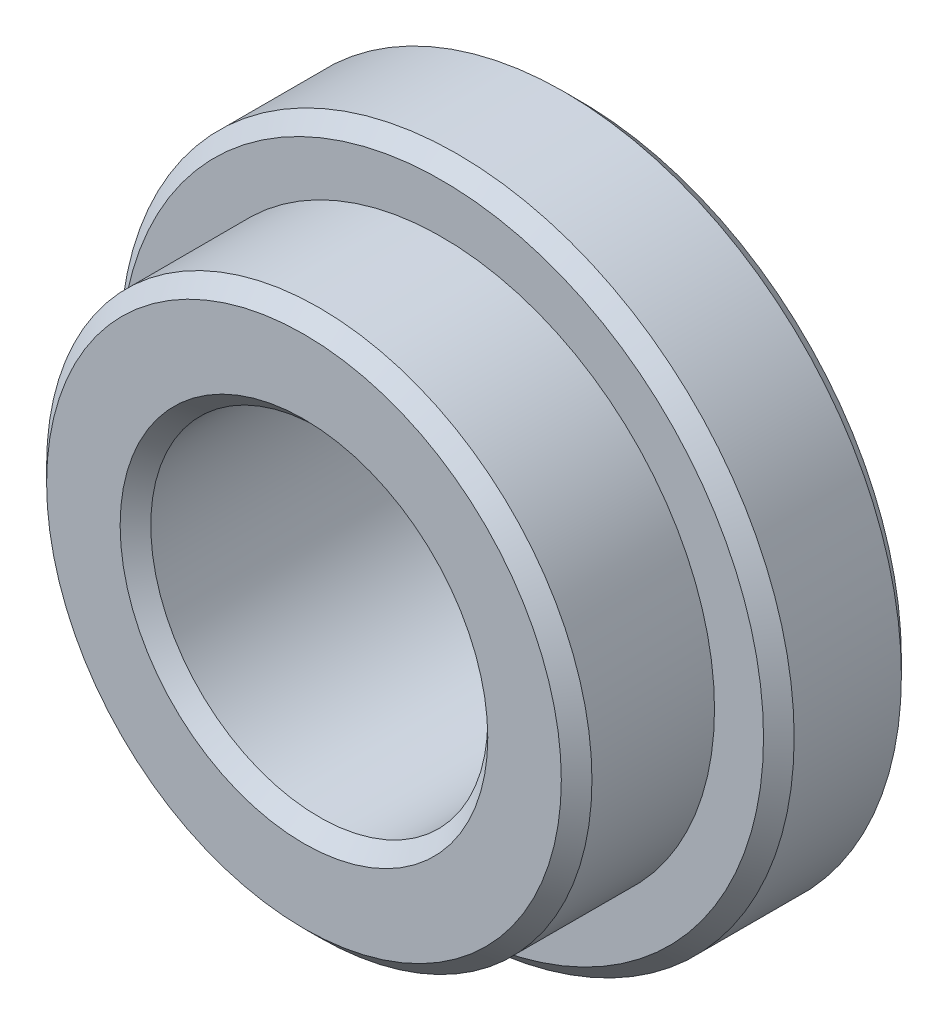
ISO-10303-21;
HEADER;
FILE_DESCRIPTION(('STEP AP214'),'2;1');
FILE_NAME('part.step','',(''),(''),'','','');
FILE_SCHEMA(('AUTOMOTIVE_DESIGN { 1 0 10303 214 1 1 1 1 }'));
ENDSEC;
DATA;
#1=APPLICATION_CONTEXT('core data for automotive mechanical design processes');
#2=APPLICATION_PROTOCOL_DEFINITION('international standard','automotive_design',2000,#1);
#3=PRODUCT_CONTEXT('',#1,'mechanical');
#4=PRODUCT('Part','Part','',(#3));
#5=PRODUCT_RELATED_PRODUCT_CATEGORY('part','',(#4));
#6=PRODUCT_DEFINITION_FORMATION('','',#4);
#7=PRODUCT_DEFINITION_CONTEXT('part definition',#1,'design');
#8=PRODUCT_DEFINITION('design','',#6,#7);
#9=PRODUCT_DEFINITION_SHAPE('','',#8);
#10=(LENGTH_UNIT() NAMED_UNIT(*) SI_UNIT(.MILLI.,.METRE.));
#11=(NAMED_UNIT(*) PLANE_ANGLE_UNIT() SI_UNIT($,.RADIAN.));
#12=(NAMED_UNIT(*) SI_UNIT($,.STERADIAN.) SOLID_ANGLE_UNIT());
#13=UNCERTAINTY_MEASURE_WITH_UNIT(LENGTH_MEASURE(1.E-05),#10,'distance_accuracy_value','');
#14=(GEOMETRIC_REPRESENTATION_CONTEXT(3) GLOBAL_UNCERTAINTY_ASSIGNED_CONTEXT((#13)) GLOBAL_UNIT_ASSIGNED_CONTEXT((#10,
#11,#12)) REPRESENTATION_CONTEXT('',''));
#15=CARTESIAN_POINT('',(0.,0.,0.));
#16=DIRECTION('',(0.,0.,1.));
#17=DIRECTION('',(1.,0.,0.));
#18=AXIS2_PLACEMENT_3D('',#15,#16,#17);
#19=CARTESIAN_POINT('',(0.,0.,8.49999999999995));
#20=DIRECTION('',(0.,0.,-1.));
#21=DIRECTION('',(-1.,0.,0.));
#22=AXIS2_PLACEMENT_3D('',#19,#20,#21);
#23=CONICAL_SURFACE('',#22,8.89999999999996,0.785398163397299);
#24=CARTESIAN_POINT('',(0.,0.,8.49999999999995));
#25=DIRECTION('',(0.,0.,1.));
#26=DIRECTION('',(1.,0.,0.));
#27=AXIS2_PLACEMENT_3D('',#24,#25,#26);
#28=CIRCLE('',#27,8.9);
#29=CARTESIAN_POINT('',(8.9,0.,8.49999999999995));
#30=VERTEX_POINT('',#29);
#31=EDGE_CURVE('E55',#30,#30,#28,.F.);
#32=ORIENTED_EDGE('',*,*,#31,.F.);
#33=EDGE_LOOP('',(#32));
#34=FACE_BOUND('',#33,.T.);
#35=CARTESIAN_POINT('',(0.,0.,9.00000000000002));
#36=DIRECTION('',(0.,0.,-1.));
#37=DIRECTION('',(-1.,0.,0.));
#38=AXIS2_PLACEMENT_3D('',#35,#36,#37);
#39=CIRCLE('',#38,8.40000000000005);
#40=CARTESIAN_POINT('',(-8.40000000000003,0.,9.00000000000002));
#41=VERTEX_POINT('',#40);
#42=EDGE_CURVE('E19',#41,#41,#39,.F.);
#43=ORIENTED_EDGE('',*,*,#42,.F.);
#44=EDGE_LOOP('',(#43));
#45=FACE_BOUND('',#44,.T.);
#46=ADVANCED_FACE('F16',(#34,#45),#23,.T.);
#47=CARTESIAN_POINT('',(0.,0.,-0.450000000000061));
#48=DIRECTION('',(0.,0.,1.));
#49=DIRECTION('',(1.,0.,0.));
#50=AXIS2_PLACEMENT_3D('',#47,#48,#49);
#51=CYLINDRICAL_SURFACE('',#50,8.9);
#52=ORIENTED_EDGE('',*,*,#31,.T.);
#53=EDGE_LOOP('',(#52));
#54=FACE_BOUND('',#53,.T.);
#55=CARTESIAN_POINT('',(0.,0.,4.49999999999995));
#56=DIRECTION('',(0.,0.,1.));
#57=DIRECTION('',(1.,0.,0.));
#58=AXIS2_PLACEMENT_3D('',#55,#56,#57);
#59=CIRCLE('',#58,8.9);
#60=CARTESIAN_POINT('',(8.9,0.,4.49999999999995));
#61=VERTEX_POINT('',#60);
#62=EDGE_CURVE('E71',#61,#61,#59,.F.);
#63=ORIENTED_EDGE('',*,*,#62,.F.);
#64=EDGE_LOOP('',(#63));
#65=FACE_BOUND('',#64,.T.);
#66=ADVANCED_FACE('F82',(#54,#65),#51,.T.);
#67=CARTESIAN_POINT('',(0.,0.,9.00000000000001));
#68=DIRECTION('',(0.,0.,1.));
#69=DIRECTION('',(1.,0.,0.));
#70=AXIS2_PLACEMENT_3D('',#67,#68,#69);
#71=PLANE('',#70);
#72=ORIENTED_EDGE('',*,*,#42,.T.);
#73=EDGE_LOOP('',(#72));
#74=FACE_BOUND('',#73,.T.);
#75=CARTESIAN_POINT('',(0.,0.,9.00000000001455));
#76=DIRECTION('',(0.,0.,1.));
#77=DIRECTION('',(1.,0.,0.));
#78=AXIS2_PLACEMENT_3D('',#75,#76,#77);
#79=CIRCLE('',#78,5.9999999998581);
#80=CARTESIAN_POINT('',(5.99999999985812,0.,9.00000000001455));
#81=VERTEX_POINT('',#80);
#82=EDGE_CURVE('E69',#81,#81,#79,.F.);
#83=ORIENTED_EDGE('',*,*,#82,.T.);
#84=EDGE_LOOP('',(#83));
#85=FACE_BOUND('',#84,.T.);
#86=ADVANCED_FACE('F78',(#74,#85),#71,.T.);
#87=CARTESIAN_POINT('',(0.,0.,4.49999999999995));
#88=DIRECTION('',(0.,0.,1.));
#89=DIRECTION('',(1.,0.,0.));
#90=AXIS2_PLACEMENT_3D('',#87,#88,#89);
#91=PLANE('',#90);
#92=CARTESIAN_POINT('',(0.,0.,4.50000000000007));
#93=DIRECTION('',(0.,0.,-1.));
#94=DIRECTION('',(-1.,0.,0.));
#95=AXIS2_PLACEMENT_3D('',#92,#93,#94);
#96=CIRCLE('',#95,10.5);
#97=CARTESIAN_POINT('',(-10.5,0.,4.50000000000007));
#98=VERTEX_POINT('',#97);
#99=EDGE_CURVE('E54',#98,#98,#96,.T.);
#100=ORIENTED_EDGE('',*,*,#99,.F.);
#101=EDGE_LOOP('',(#100));
#102=FACE_BOUND('',#101,.T.);
#103=ORIENTED_EDGE('',*,*,#62,.T.);
#104=EDGE_LOOP('',(#103));
#105=FACE_BOUND('',#104,.T.);
#106=ADVANCED_FACE('F130',(#102,#105),#91,.T.);
#107=CARTESIAN_POINT('',(0.,0.,9.00000000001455));
#108=DIRECTION('',(0.,0.,1.));
#109=DIRECTION('',(1.,0.,0.));
#110=AXIS2_PLACEMENT_3D('',#107,#108,#109);
#111=CONICAL_SURFACE('',#110,5.9999999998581,0.785398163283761);
#112=CARTESIAN_POINT('',(0.,0.,8.49999999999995));
#113=DIRECTION('',(0.,0.,1.));
#114=DIRECTION('',(1.,0.,0.));
#115=AXIS2_PLACEMENT_3D('',#112,#113,#114);
#116=CIRCLE('',#115,5.5);
#117=CARTESIAN_POINT('',(5.5,0.,8.49999999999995));
#118=VERTEX_POINT('',#117);
#119=EDGE_CURVE('E48',#118,#118,#116,.F.);
#120=ORIENTED_EDGE('',*,*,#119,.T.);
#121=EDGE_LOOP('',(#120));
#122=FACE_BOUND('',#121,.T.);
#123=ORIENTED_EDGE('',*,*,#82,.F.);
#124=EDGE_LOOP('',(#123));
#125=FACE_BOUND('',#124,.T.);
#126=ADVANCED_FACE('F126',(#122,#125),#111,.F.);
#127=CARTESIAN_POINT('',(0.,0.,4.));
#128=DIRECTION('',(0.,0.,-1.));
#129=DIRECTION('',(-1.,0.,0.));
#130=AXIS2_PLACEMENT_3D('',#127,#128,#129);
#131=CONICAL_SURFACE('',#130,11.,0.785398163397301);
#132=CARTESIAN_POINT('',(0.,0.,4.));
#133=DIRECTION('',(0.,0.,1.));
#134=DIRECTION('',(1.,0.,0.));
#135=AXIS2_PLACEMENT_3D('',#132,#133,#134);
#136=CIRCLE('',#135,11.);
#137=CARTESIAN_POINT('',(11.,0.,4.));
#138=VERTEX_POINT('',#137);
#139=EDGE_CURVE('E42',#138,#138,#136,.F.);
#140=ORIENTED_EDGE('',*,*,#139,.F.);
#141=EDGE_LOOP('',(#140));
#142=FACE_BOUND('',#141,.T.);
#143=ORIENTED_EDGE('',*,*,#99,.T.);
#144=EDGE_LOOP('',(#143));
#145=FACE_BOUND('',#144,.T.);
#146=ADVANCED_FACE('F35',(#142,#145),#131,.T.);
#147=CARTESIAN_POINT('',(-8.50000000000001,0.,2.9999999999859));
#148=DIRECTION('',(0.,0.,-1.));
#149=DIRECTION('',(0.,1.,0.));
#150=AXIS2_PLACEMENT_3D('',#147,#148,#149);
#151=CONICAL_SURFACE('',#150,1.55000000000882,1.08210413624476);
#152=CARTESIAN_POINT('',(-8.50000000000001,0.,3.82414961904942));
#153=VERTEX_POINT('',#152);
#154=VERTEX_LOOP('',#153);
#155=FACE_BOUND('',#154,.T.);
#156=CARTESIAN_POINT('',(-8.50000000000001,0.,3.));
#157=DIRECTION('',(0.,0.,1.));
#158=DIRECTION('',(1.,0.,0.));
#159=AXIS2_PLACEMENT_3D('',#156,#157,#158);
#160=CIRCLE('',#159,1.55);
#161=CARTESIAN_POINT('',(-6.95000000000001,0.,3.));
#162=VERTEX_POINT('',#161);
#163=EDGE_CURVE('E39',#162,#162,#160,.F.);
#164=ORIENTED_EDGE('',*,*,#163,.T.);
#165=EDGE_LOOP('',(#164));
#166=FACE_BOUND('',#165,.T.);
#167=ADVANCED_FACE('F31',(#155,#166),#151,.F.);
#168=CARTESIAN_POINT('',(8.50000000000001,0.,3.00000000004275));
#169=DIRECTION('',(0.,0.,-1.));
#170=DIRECTION('',(-1.,0.,0.));
#171=AXIS2_PLACEMENT_3D('',#168,#169,#170);
#172=CONICAL_SURFACE('',#171,1.54999999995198,1.08210413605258);
#173=CARTESIAN_POINT('',(8.50000000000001,0.,3.82414961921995));
#174=VERTEX_POINT('',#173);
#175=VERTEX_LOOP('',#174);
#176=FACE_BOUND('',#175,.T.);
#177=CARTESIAN_POINT('',(8.50000000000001,0.,3.));
#178=DIRECTION('',(0.,0.,-1.));
#179=DIRECTION('',(-1.,0.,0.));
#180=AXIS2_PLACEMENT_3D('',#177,#178,#179);
#181=CIRCLE('',#180,1.55);
#182=CARTESIAN_POINT('',(6.95000000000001,0.,3.));
#183=VERTEX_POINT('',#182);
#184=EDGE_CURVE('E41',#183,#183,#181,.T.);
#185=ORIENTED_EDGE('',*,*,#184,.T.);
#186=EDGE_LOOP('',(#185));
#187=FACE_BOUND('',#186,.T.);
#188=ADVANCED_FACE('F34',(#176,#187),#172,.F.);
#189=CARTESIAN_POINT('',(0.,0.,0.));
#190=DIRECTION('',(0.,0.,1.));
#191=DIRECTION('',(1.,0.,0.));
#192=AXIS2_PLACEMENT_3D('',#189,#190,#191);
#193=CYLINDRICAL_SURFACE('',#192,5.5);
#194=CARTESIAN_POINT('',(0.,0.,0.499999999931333));
#195=DIRECTION('',(0.,0.,-1.));
#196=DIRECTION('',(-1.,0.,0.));
#197=AXIS2_PLACEMENT_3D('',#194,#195,#196);
#198=CIRCLE('',#197,5.49999999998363);
#199=CARTESIAN_POINT('',(-5.49999999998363,0.,0.499999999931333));
#200=VERTEX_POINT('',#199);
#201=EDGE_CURVE('E45',#200,#200,#198,.T.);
#202=ORIENTED_EDGE('',*,*,#201,.T.);
#203=EDGE_LOOP('',(#202));
#204=FACE_BOUND('',#203,.T.);
#205=ORIENTED_EDGE('',*,*,#119,.F.);
#206=EDGE_LOOP('',(#205));
#207=FACE_BOUND('',#206,.T.);
#208=ADVANCED_FACE('F117',(#204,#207),#193,.F.);
#209=CARTESIAN_POINT('',(0.,0.,-0.450000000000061));
#210=DIRECTION('',(0.,0.,1.));
#211=DIRECTION('',(1.,0.,0.));
#212=AXIS2_PLACEMENT_3D('',#209,#210,#211);
#213=CYLINDRICAL_SURFACE('',#212,11.);
#214=ORIENTED_EDGE('',*,*,#139,.T.);
#215=EDGE_LOOP('',(#214));
#216=FACE_BOUND('',#215,.T.);
#217=CARTESIAN_POINT('',(0.,0.,0.500000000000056));
#218=DIRECTION('',(0.,0.,1.));
#219=DIRECTION('',(1.,0.,0.));
#220=AXIS2_PLACEMENT_3D('',#217,#218,#219);
#221=CIRCLE('',#220,11.);
#222=CARTESIAN_POINT('',(11.,0.,0.500000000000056));
#223=VERTEX_POINT('',#222);
#224=EDGE_CURVE('E66',#223,#223,#221,.F.);
#225=ORIENTED_EDGE('',*,*,#224,.F.);
#226=EDGE_LOOP('',(#225));
#227=FACE_BOUND('',#226,.T.);
#228=ADVANCED_FACE('F114',(#216,#227),#213,.T.);
#229=CARTESIAN_POINT('',(-8.50000000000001,0.,4.01535710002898));
#230=DIRECTION('',(0.,0.,1.));
#231=DIRECTION('',(1.,0.,0.));
#232=AXIS2_PLACEMENT_3D('',#229,#230,#231);
#233=CYLINDRICAL_SURFACE('',#232,1.55);
#234=ORIENTED_EDGE('',*,*,#163,.F.);
#235=EDGE_LOOP('',(#234));
#236=FACE_BOUND('',#235,.T.);
#237=CARTESIAN_POINT('',(-8.50000000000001,0.,0.));
#238=DIRECTION('',(0.,0.,1.));
#239=DIRECTION('',(1.,0.,0.));
#240=AXIS2_PLACEMENT_3D('',#237,#238,#239);
#241=CIRCLE('',#240,1.55);
#242=CARTESIAN_POINT('',(-6.95000000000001,0.,0.));
#243=VERTEX_POINT('',#242);
#244=EDGE_CURVE('E63',#243,#243,#241,.F.);
#245=ORIENTED_EDGE('',*,*,#244,.T.);
#246=EDGE_LOOP('',(#245));
#247=FACE_BOUND('',#246,.T.);
#248=ADVANCED_FACE('F110',(#236,#247),#233,.F.);
#249=CARTESIAN_POINT('',(8.50000000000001,0.,4.01535710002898));
#250=DIRECTION('',(0.,0.,-1.));
#251=DIRECTION('',(-1.,0.,0.));
#252=AXIS2_PLACEMENT_3D('',#249,#250,#251);
#253=CYLINDRICAL_SURFACE('',#252,1.55);
#254=ORIENTED_EDGE('',*,*,#184,.F.);
#255=EDGE_LOOP('',(#254));
#256=FACE_BOUND('',#255,.T.);
#257=CARTESIAN_POINT('',(8.50000000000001,0.,0.));
#258=DIRECTION('',(0.,0.,-1.));
#259=DIRECTION('',(-1.,0.,0.));
#260=AXIS2_PLACEMENT_3D('',#257,#258,#259);
#261=CIRCLE('',#260,1.55);
#262=CARTESIAN_POINT('',(6.95000000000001,0.,0.));
#263=VERTEX_POINT('',#262);
#264=EDGE_CURVE('E60',#263,#263,#261,.T.);
#265=ORIENTED_EDGE('',*,*,#264,.T.);
#266=EDGE_LOOP('',(#265));
#267=FACE_BOUND('',#266,.T.);
#268=ADVANCED_FACE('F106',(#256,#267),#253,.F.);
#269=CARTESIAN_POINT('',(0.,0.,5.6843418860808E-11));
#270=DIRECTION('',(0.,0.,-1.));
#271=DIRECTION('',(-1.,0.,0.));
#272=AXIS2_PLACEMENT_3D('',#269,#270,#271);
#273=CONICAL_SURFACE('',#272,5.99999999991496,0.785398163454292);
#274=ORIENTED_EDGE('',*,*,#201,.F.);
#275=EDGE_LOOP('',(#274));
#276=FACE_BOUND('',#275,.T.);
#277=CARTESIAN_POINT('',(0.,0.,5.6843418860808E-11));
#278=DIRECTION('',(0.,0.,-1.));
#279=DIRECTION('',(-1.,0.,0.));
#280=AXIS2_PLACEMENT_3D('',#277,#278,#279);
#281=CIRCLE('',#280,5.99999999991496);
#282=CARTESIAN_POINT('',(-5.99999999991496,0.,5.6843418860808E-11));
#283=VERTEX_POINT('',#282);
#284=EDGE_CURVE('E25',#283,#283,#281,.T.);
#285=ORIENTED_EDGE('',*,*,#284,.T.);
#286=EDGE_LOOP('',(#285));
#287=FACE_BOUND('',#286,.T.);
#288=ADVANCED_FACE('F98',(#276,#287),#273,.F.);
#289=CARTESIAN_POINT('',(0.,0.,0.500000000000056));
#290=DIRECTION('',(0.,0.,1.));
#291=DIRECTION('',(1.,0.,0.));
#292=AXIS2_PLACEMENT_3D('',#289,#290,#291);
#293=CONICAL_SURFACE('',#292,11.,0.7853981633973);
#294=ORIENTED_EDGE('',*,*,#224,.T.);
#295=EDGE_LOOP('',(#294));
#296=FACE_BOUND('',#295,.T.);
#297=CARTESIAN_POINT('',(0.,0.,0.));
#298=DIRECTION('',(0.,0.,1.));
#299=DIRECTION('',(1.,0.,0.));
#300=AXIS2_PLACEMENT_3D('',#297,#298,#299);
#301=CIRCLE('',#300,10.5);
#302=CARTESIAN_POINT('',(10.5,0.,0.));
#303=VERTEX_POINT('',#302);
#304=EDGE_CURVE('E11',#303,#303,#301,.T.);
#305=ORIENTED_EDGE('',*,*,#304,.T.);
#306=EDGE_LOOP('',(#305));
#307=FACE_BOUND('',#306,.T.);
#308=ADVANCED_FACE('F92',(#296,#307),#293,.T.);
#309=CARTESIAN_POINT('',(0.,0.,0.));
#310=DIRECTION('',(0.,0.,1.));
#311=DIRECTION('',(1.,0.,0.));
#312=AXIS2_PLACEMENT_3D('',#309,#310,#311);
#313=PLANE('',#312);
#314=ORIENTED_EDGE('',*,*,#304,.F.);
#315=EDGE_LOOP('',(#314));
#316=FACE_BOUND('',#315,.T.);
#317=ORIENTED_EDGE('',*,*,#284,.F.);
#318=EDGE_LOOP('',(#317));
#319=FACE_BOUND('',#318,.T.);
#320=ORIENTED_EDGE('',*,*,#264,.F.);
#321=EDGE_LOOP('',(#320));
#322=FACE_BOUND('',#321,.T.);
#323=ORIENTED_EDGE('',*,*,#244,.F.);
#324=EDGE_LOOP('',(#323));
#325=FACE_BOUND('',#324,.T.);
#326=ADVANCED_FACE('F90',(#316,#319,#322,#325),#313,.F.);
#327=CLOSED_SHELL('',(#46,#66,#86,#106,#126,#146,#167,#188,#208,#228,#248,#268,#288,#308,#326));
#328=MANIFOLD_SOLID_BREP('B1',#327);
#329=ADVANCED_BREP_SHAPE_REPRESENTATION('',(#18,#328),#14);
#330=SHAPE_DEFINITION_REPRESENTATION(#9,#329);
ENDSEC;
END-ISO-10303-21;
